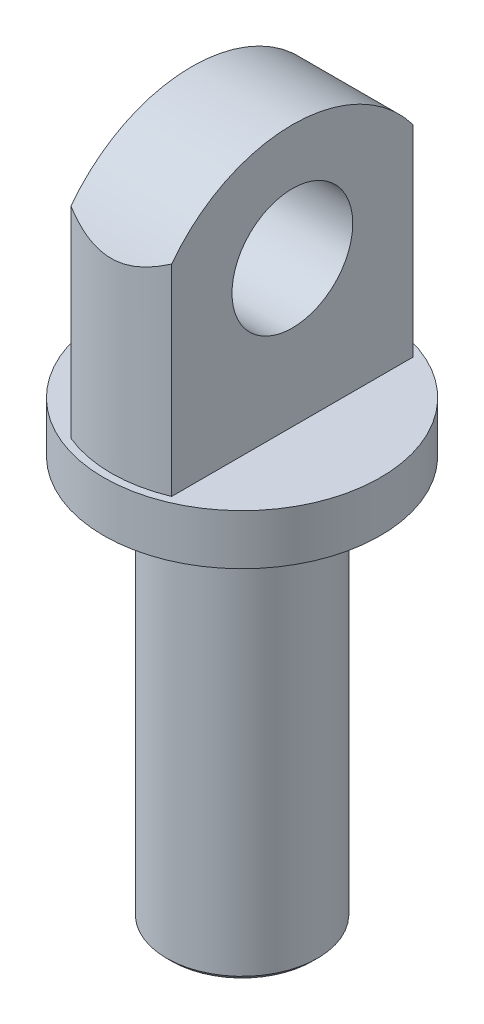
from build123d import *

# Parameters (mm, degrees)
ESQUISSE2_R      = 15
EXTRUSION1_DEPTH = 80
ESQUISSE3_R      = 27.5
EXTRUSION2_DEPTH = 10
EXTRUSION3_DEPTH = 52
ESQUISSE5_R      = 12
EXTRUSION4_DEPTH = 52
CHANFREIN1_SIZE  = 1


with BuildPart() as part:
    # Esquisse2 → Extrusion1 (new body)
    with BuildSketch(Plane(origin=(0, 0, 0), x_dir=(1, 0, 0), z_dir=(0, 1, 0))):
        with Locations(Location((0, 0, 0), (0, 0, 270))):
            Circle(ESQUISSE2_R)
    extrude(amount=EXTRUSION1_DEPTH)

    # Esquisse3 → Extrusion2 (add)
    with BuildSketch(Plane(origin=(0, 80, 0), x_dir=(1, 0, 0), z_dir=(0, 1, 0))):
        with Locations(Location((0, 0, 0), (0, 0, 270))):
            Circle(ESQUISSE3_R)
    extrude(amount=EXTRUSION2_DEPTH)

    # Esquisse4 → Extrusion3 (add)
    with BuildSketch(Plane(origin=(0, 90, 0), x_dir=(1, 0, 0), z_dir=(0, 1, 0))):
        with BuildLine():
            Line((-10, 24), (-10, -24))
            ThreePointArc((-10, -24), (0, -26), (10, -24))
            Line((10, -24), (10, 24))
            ThreePointArc((10, 24), (0, 26), (-10, 24))
        make_face()
    extrude(amount=EXTRUSION3_DEPTH)

    # Esquisse5 → Extrusion4 (cut)
    with BuildSketch(Plane(origin=(10, 0, 0), x_dir=(0, 0, -1), z_dir=(1, 0, 0))):
        with Locations((0, 119)):
            Circle(ESQUISSE5_R)
        with BuildLine():
            Line((-26, 126.966629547), (-41.617597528, 129.579634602))
            Line((-41.617597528, 129.579634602), (-38.261281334, 149.639907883))
            Line((-38.261281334, 149.639907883), (33.672419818, 149.639907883))
            Line((33.672419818, 149.639907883), (39.536717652, 135.06559064))
            Line((39.536717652, 135.06559064), (26, 126.966629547))
            ThreePointArc((26, 126.966629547), (0, 142), (-26, 126.966629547))
        make_face()
    extrude(amount=-EXTRUSION4_DEPTH, mode=Mode.SUBTRACT)

    # Chanfrein1
    chanfrein1_edges = [part.edges().sort_by_distance(p)[0] for p in [
        (0, 0, -15),
    ]]
    chamfer(chanfrein1_edges, length=CHANFREIN1_SIZE)


solid = part.part
